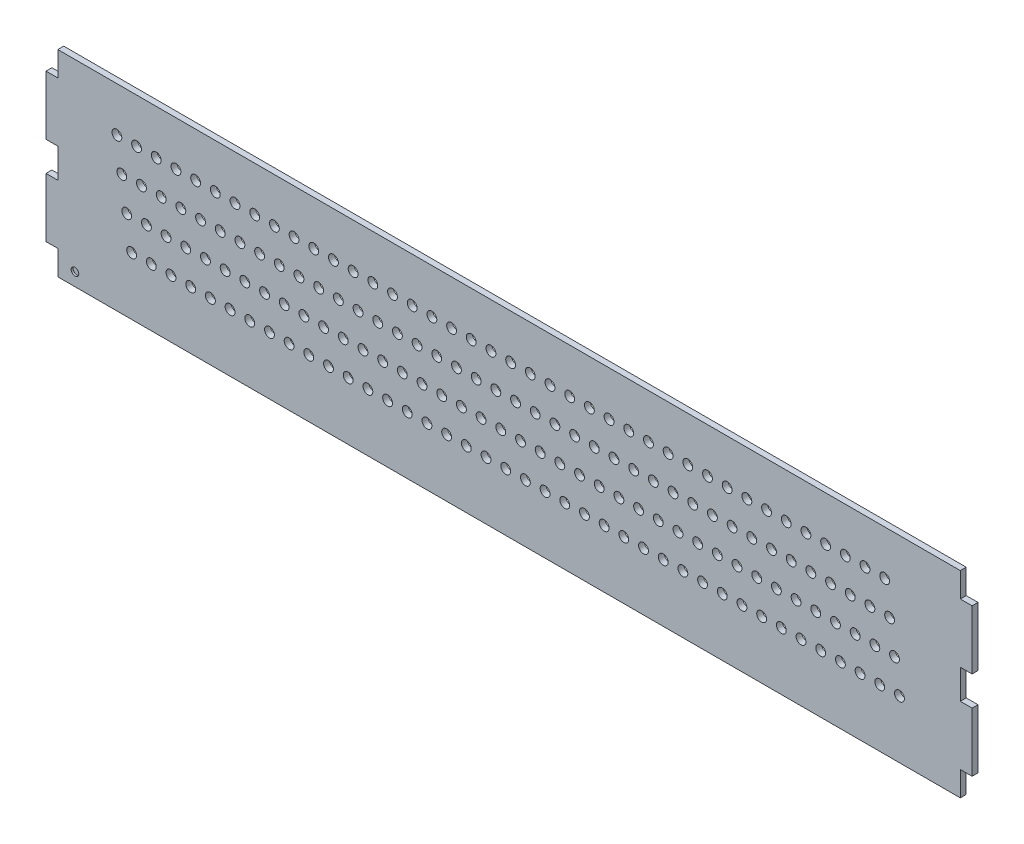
from build123d import *

# Parameters (mm, degrees)
CROQUIS1_W              = 458.4
CROQUIS1_H              = 100
SALIENTE_EXTRUIR1_DEPTH = 3
CROQUIS2_W              = 3
CROQUIS2_H              = 30
SALIENTE_EXTRUIR2_DEPTH = 6
CROQUIS3_W              = 3
CROQUIS3_H              = 30
SALIENTE_EXTRUIR3_DEPTH = 6
CORTAR_EXTRUIR1_REACH   = 242.475
CROQUIS4_R              = 2.5
MATRIZL1_COUNT          = 40
MATRIZL1_PITCH          = 10
CROQUIS5_R              = 1.93471248
CORTAR_EXTRUIR2_DEPTH   = 1


with BuildPart() as part:
    # Croquis1 → Saliente-Extruir1 (new body)
    with BuildSketch(Plane.XY):
        Rectangle(CROQUIS1_W, CROQUIS1_H)
    extrude(amount=SALIENTE_EXTRUIR1_DEPTH)

    # Croquis2 → Saliente-Extruir2 (add)
    with BuildSketch(Plane.ZY.offset(229.2)):
        with Locations((1.5, 22.5)):
            Rectangle(CROQUIS2_W, CROQUIS2_H)
        with Locations((1.5, -22.5)):
            Rectangle(CROQUIS2_W, CROQUIS2_H)
    extrude(amount=SALIENTE_EXTRUIR2_DEPTH)

    # Croquis3 → Saliente-Extruir3 (add)
    with BuildSketch(Plane(origin=(229.2, 0, 0), x_dir=(0, 0, -1), z_dir=(1, 0, 0))):
        with Locations((-1.5, -22.5)):
            Rectangle(CROQUIS3_W, CROQUIS3_H)
        with Locations((-1.5, 22.5)):
            Rectangle(CROQUIS3_W, CROQUIS3_H)
    extrude(amount=SALIENTE_EXTRUIR3_DEPTH)

    # Croquis4 → Cortar-Extruir1 (cut, up to next)
    with BuildSketch(Plane.XY.offset(3), mode=Mode.PRIVATE) as cortar_extruir1_sk1:
        with Locations((-199.2, 27.4)):
            Circle(CROQUIS4_R)
    cortar_extruir1_tool1 = extrude(cortar_extruir1_sk1.sketch, amount=-CORTAR_EXTRUIR1_REACH, mode=Mode.PRIVATE) & part.part
    # Croquis4 → Cortar-Extruir1 (cut, up to next)
    with BuildSketch(Plane.XY.offset(3), mode=Mode.PRIVATE) as cortar_extruir1_sk2:
        with Locations((-196.7, 11.4)):
            Circle(CROQUIS4_R)
    cortar_extruir1_tool2 = extrude(cortar_extruir1_sk2.sketch, amount=-CORTAR_EXTRUIR1_REACH, mode=Mode.PRIVATE) & part.part
    # Croquis4 → Cortar-Extruir1 (cut, up to next)
    with BuildSketch(Plane.XY.offset(3), mode=Mode.PRIVATE) as cortar_extruir1_sk3:
        with Locations((-194.2, -4.6)):
            Circle(CROQUIS4_R)
    cortar_extruir1_tool3 = extrude(cortar_extruir1_sk3.sketch, amount=-CORTAR_EXTRUIR1_REACH, mode=Mode.PRIVATE) & part.part
    # Croquis4 → Cortar-Extruir1 (cut, up to next)
    with BuildSketch(Plane.XY.offset(3), mode=Mode.PRIVATE) as cortar_extruir1_sk4:
        with Locations((-191.7, -20.6)):
            Circle(CROQUIS4_R)
    cortar_extruir1_tool4 = extrude(cortar_extruir1_sk4.sketch, amount=-CORTAR_EXTRUIR1_REACH, mode=Mode.PRIVATE) & part.part
    cortar_extruir1_1 = cortar_extruir1_tool1.solids().sort_by_distance((-199.2, 27.4, 3))[0]
    add(cortar_extruir1_1, mode=Mode.SUBTRACT)
    cortar_extruir1_2 = cortar_extruir1_tool2.solids().sort_by_distance((-196.7, 11.4, 3))[0]
    add(cortar_extruir1_2, mode=Mode.SUBTRACT)
    cortar_extruir1_3 = cortar_extruir1_tool3.solids().sort_by_distance((-194.2, -4.6, 3))[0]
    add(cortar_extruir1_3, mode=Mode.SUBTRACT)
    cortar_extruir1_4 = cortar_extruir1_tool4.solids().sort_by_distance((-191.7, -20.6, 3))[0]
    add(cortar_extruir1_4, mode=Mode.SUBTRACT)
    cortar_extruir1 = cortar_extruir1_1 + cortar_extruir1_2 + cortar_extruir1_3 + cortar_extruir1_4  # Cortar-Extruir1 as one shape, for the pattern or mirror that repeats it

    # MatrizL1: Cortar-Extruir1 ×40
    with Locations(*[(i * MATRIZL1_PITCH, 0, 0) for i in range(1, MATRIZL1_COUNT)]):
        add(cortar_extruir1, mode=Mode.SUBTRACT)

    # Croquis5 → Cortar-Extruir2 (cut)
    with BuildSketch(Plane.XY.offset(3)):
        with Locations((-220.478380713, -43.374846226)):
            Circle(CROQUIS5_R)
    extrude(amount=-CORTAR_EXTRUIR2_DEPTH, mode=Mode.SUBTRACT)


solid = part.part
